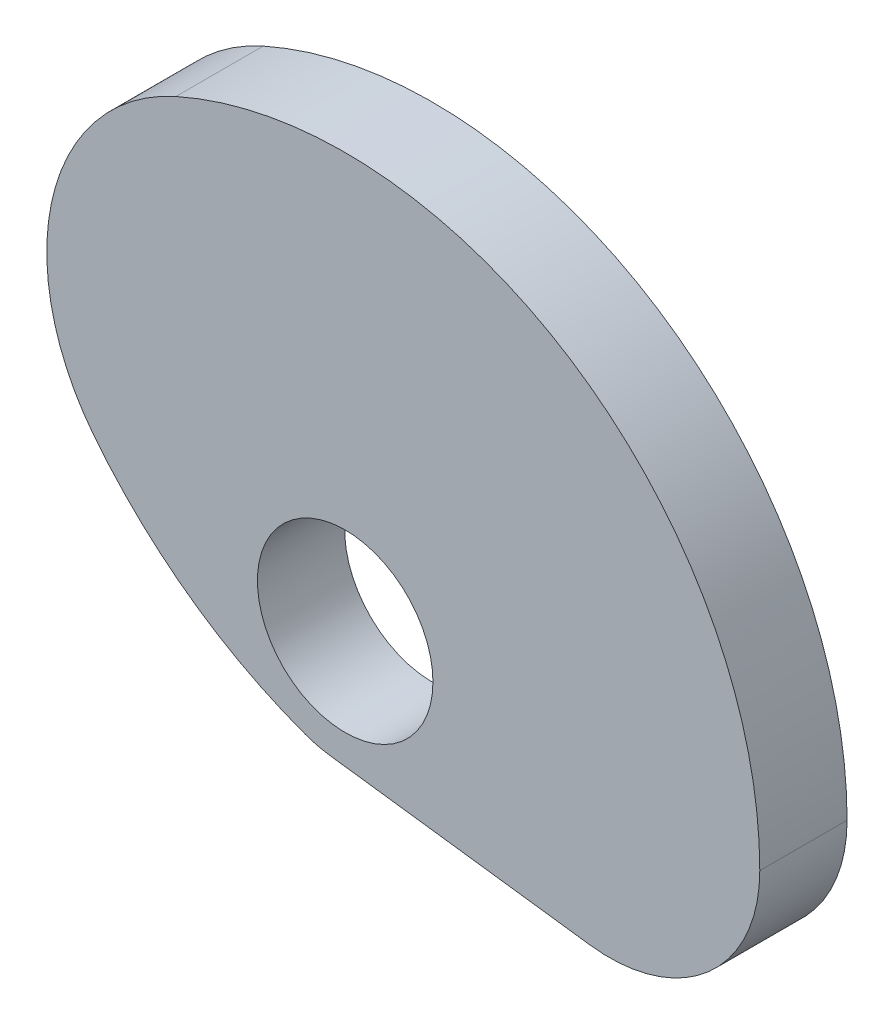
from build123d import *

# Parameters (mm, degrees)
ESQUISSE1_R      = 20.110417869
EXTRUSION1_DEPTH = 10


with BuildPart() as part:
    # Esquisse1 → Extrusion1 (new, symmetric)
    with BuildSketch(Plane.XY):
        with BuildLine():
            Line((-3.461873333, -26.409063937), (56.016076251, -34.205823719))
            ThreePointArc((56.016076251, -34.205823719), (83.25363126, -25.930989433), (94.998462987, 0))
            ThreePointArc((94.998462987, 0), (51.675152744, 79.714406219), (-38.780260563, 86.722542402))
            ThreePointArc((-38.780260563, 86.722542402), (-66.91520491, 53.04593053), (-57.654270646, 10.151590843))
            ThreePointArc((-57.654270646, 10.151590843), (-35.850229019, -10.805152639), (-9.153017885, -25.012905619))
            ThreePointArc((-9.153017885, -25.012905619), (-6.345958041, -25.867972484), (-3.461873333, -26.409063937))
        make_face()
        Circle(ESQUISSE1_R, mode=Mode.SUBTRACT)
    extrude(amount=EXTRUSION1_DEPTH, both=True)


solid = part.part
